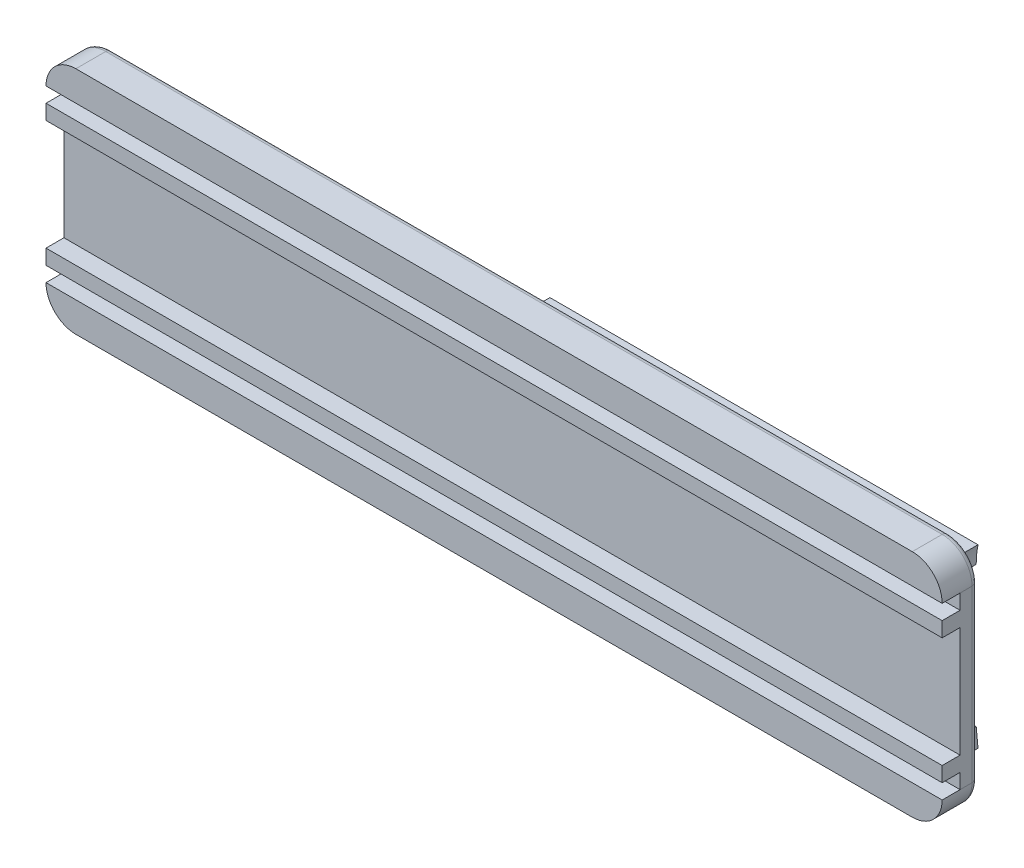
ISO-10303-21;
HEADER;
FILE_DESCRIPTION(('STEP AP214'),'2;1');
FILE_NAME('part.step','',(''),(''),'','','');
FILE_SCHEMA(('AUTOMOTIVE_DESIGN { 1 0 10303 214 1 1 1 1 }'));
ENDSEC;
DATA;
#1=APPLICATION_CONTEXT('core data for automotive mechanical design processes');
#2=APPLICATION_PROTOCOL_DEFINITION('international standard','automotive_design',2000,#1);
#3=PRODUCT_CONTEXT('',#1,'mechanical');
#4=PRODUCT('Part','Part','',(#3));
#5=PRODUCT_RELATED_PRODUCT_CATEGORY('part','',(#4));
#6=PRODUCT_DEFINITION_FORMATION('','',#4);
#7=PRODUCT_DEFINITION_CONTEXT('part definition',#1,'design');
#8=PRODUCT_DEFINITION('design','',#6,#7);
#9=PRODUCT_DEFINITION_SHAPE('','',#8);
#10=(LENGTH_UNIT() NAMED_UNIT(*) SI_UNIT(.MILLI.,.METRE.));
#11=(NAMED_UNIT(*) PLANE_ANGLE_UNIT() SI_UNIT($,.RADIAN.));
#12=(NAMED_UNIT(*) SI_UNIT($,.STERADIAN.) SOLID_ANGLE_UNIT());
#13=UNCERTAINTY_MEASURE_WITH_UNIT(LENGTH_MEASURE(1.E-05),#10,'distance_accuracy_value','');
#14=(GEOMETRIC_REPRESENTATION_CONTEXT(3) GLOBAL_UNCERTAINTY_ASSIGNED_CONTEXT((#13)) GLOBAL_UNIT_ASSIGNED_CONTEXT((#10,
#11,#12)) REPRESENTATION_CONTEXT('',''));
#15=CARTESIAN_POINT('',(0.,0.,0.));
#16=DIRECTION('',(0.,0.,1.));
#17=DIRECTION('',(1.,0.,0.));
#18=AXIS2_PLACEMENT_3D('',#15,#16,#17);
#19=CARTESIAN_POINT('',(56.,5.99999999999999,22.));
#20=DIRECTION('',(-1.,0.,0.));
#21=DIRECTION('',(0.,-1.,0.));
#22=AXIS2_PLACEMENT_3D('',#19,#20,#21);
#23=PLANE('',#22);
#24=DIRECTION('',(0.,0.,-1.));
#25=VECTOR('',#24,1.);
#26=CARTESIAN_POINT('',(56.,-61.,22.));
#27=LINE('',#26,#25);
#28=CARTESIAN_POINT('',(56.,-61.,16.));
#29=VERTEX_POINT('',#28);
#30=CARTESIAN_POINT('',(56.,-61.,12.));
#31=VERTEX_POINT('',#30);
#32=EDGE_CURVE('E403',#29,#31,#27,.T.);
#33=ORIENTED_EDGE('',*,*,#32,.T.);
#34=DIRECTION('',(0.,1.,0.));
#35=VECTOR('',#34,1.);
#36=CARTESIAN_POINT('',(56.,-4.00000000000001,12.));
#37=LINE('',#36,#35);
#38=CARTESIAN_POINT('',(56.,-4.00000000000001,12.));
#39=VERTEX_POINT('',#38);
#40=EDGE_CURVE('E458',#31,#39,#37,.T.);
#41=ORIENTED_EDGE('',*,*,#40,.T.);
#42=DIRECTION('',(0.,0.,-1.));
#43=VECTOR('',#42,1.);
#44=CARTESIAN_POINT('',(56.,-4.00000000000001,22.));
#45=LINE('',#44,#43);
#46=CARTESIAN_POINT('',(56.,-4.00000000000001,16.));
#47=VERTEX_POINT('',#46);
#48=EDGE_CURVE('E260',#39,#47,#45,.F.);
#49=ORIENTED_EDGE('',*,*,#48,.T.);
#50=DIRECTION('',(0.,1.,0.));
#51=VECTOR('',#50,1.);
#52=CARTESIAN_POINT('',(56.,0.,16.));
#53=LINE('',#52,#51);
#54=CARTESIAN_POINT('',(56.,-9.00000000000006,16.));
#55=VERTEX_POINT('',#54);
#56=EDGE_CURVE('E253',#55,#47,#53,.T.);
#57=ORIENTED_EDGE('',*,*,#56,.F.);
#58=DIRECTION('',(0.,0.,1.));
#59=VECTOR('',#58,1.);
#60=CARTESIAN_POINT('',(56.,-9.00000000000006,16.));
#61=LINE('',#60,#59);
#62=CARTESIAN_POINT('',(56.,-9.00000000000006,22.));
#63=VERTEX_POINT('',#62);
#64=EDGE_CURVE('E235',#55,#63,#61,.T.);
#65=ORIENTED_EDGE('',*,*,#64,.T.);
#66=DIRECTION('',(0.,1.,0.));
#67=VECTOR('',#66,1.);
#68=CARTESIAN_POINT('',(56.,5.99999999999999,22.));
#69=LINE('',#68,#67);
#70=CARTESIAN_POINT('',(56.,-14.,22.));
#71=VERTEX_POINT('',#70);
#72=EDGE_CURVE('E356',#71,#63,#69,.T.);
#73=ORIENTED_EDGE('',*,*,#72,.F.);
#74=DIRECTION('',(0.,0.,1.));
#75=VECTOR('',#74,1.);
#76=CARTESIAN_POINT('',(56.,-14.,16.));
#77=LINE('',#76,#75);
#78=CARTESIAN_POINT('',(56.,-14.,16.));
#79=VERTEX_POINT('',#78);
#80=EDGE_CURVE('E319',#79,#71,#77,.T.);
#81=ORIENTED_EDGE('',*,*,#80,.F.);
#82=DIRECTION('',(0.,1.,0.));
#83=VECTOR('',#82,1.);
#84=CARTESIAN_POINT('',(56.,0.,16.));
#85=LINE('',#84,#83);
#86=CARTESIAN_POINT('',(56.,-51.0000000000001,16.));
#87=VERTEX_POINT('',#86);
#88=EDGE_CURVE('E305',#87,#79,#85,.T.);
#89=ORIENTED_EDGE('',*,*,#88,.F.);
#90=DIRECTION('',(0.,0.,1.));
#91=VECTOR('',#90,1.);
#92=CARTESIAN_POINT('',(56.,-51.0000000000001,16.));
#93=LINE('',#92,#91);
#94=CARTESIAN_POINT('',(56.,-51.0000000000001,22.));
#95=VERTEX_POINT('',#94);
#96=EDGE_CURVE('E321',#87,#95,#93,.T.);
#97=ORIENTED_EDGE('',*,*,#96,.T.);
#98=CARTESIAN_POINT('',(56.,-56.0000000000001,22.));
#99=VERTEX_POINT('',#98);
#100=EDGE_CURVE('E357',#99,#95,#69,.T.);
#101=ORIENTED_EDGE('',*,*,#100,.F.);
#102=DIRECTION('',(0.,0.,1.));
#103=VECTOR('',#102,1.);
#104=CARTESIAN_POINT('',(56.,-56.0000000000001,16.));
#105=LINE('',#104,#103);
#106=CARTESIAN_POINT('',(56.,-56.0000000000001,16.));
#107=VERTEX_POINT('',#106);
#108=EDGE_CURVE('E268',#107,#99,#105,.T.);
#109=ORIENTED_EDGE('',*,*,#108,.F.);
#110=DIRECTION('',(0.,-1.,0.));
#111=VECTOR('',#110,1.);
#112=CARTESIAN_POINT('',(55.9999999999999,0.,16.));
#113=LINE('',#112,#111);
#114=EDGE_CURVE('E285',#107,#29,#113,.T.);
#115=ORIENTED_EDGE('',*,*,#114,.T.);
#116=EDGE_LOOP('',(#33,#41,#49,#57,#65,#73,#81,#89,#97,#101,#109,#115));
#117=FACE_BOUND('',#116,.T.);
#118=ADVANCED_FACE('F38',(#117),#23,.F.);
#119=CARTESIAN_POINT('',(-244.,5.99999999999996,22.));
#120=DIRECTION('',(1.,0.,0.));
#121=DIRECTION('',(0.,0.,-1.));
#122=AXIS2_PLACEMENT_3D('',#119,#120,#121);
#123=PLANE('',#122);
#124=DIRECTION('',(0.,0.,-1.));
#125=VECTOR('',#124,1.);
#126=CARTESIAN_POINT('',(-244.,-4.00000000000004,22.));
#127=LINE('',#126,#125);
#128=CARTESIAN_POINT('',(-244.,-4.00000000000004,16.));
#129=VERTEX_POINT('',#128);
#130=CARTESIAN_POINT('',(-244.,-4.00000000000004,12.));
#131=VERTEX_POINT('',#130);
#132=EDGE_CURVE('E427',#129,#131,#127,.T.);
#133=ORIENTED_EDGE('',*,*,#132,.T.);
#134=DIRECTION('',(0.,-1.,0.));
#135=VECTOR('',#134,1.);
#136=CARTESIAN_POINT('',(-244.,-61.0000000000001,12.));
#137=LINE('',#136,#135);
#138=CARTESIAN_POINT('',(-244.,-61.0000000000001,12.));
#139=VERTEX_POINT('',#138);
#140=EDGE_CURVE('E450',#131,#139,#137,.T.);
#141=ORIENTED_EDGE('',*,*,#140,.T.);
#142=DIRECTION('',(0.,0.,-1.));
#143=VECTOR('',#142,1.);
#144=CARTESIAN_POINT('',(-244.,-61.0000000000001,22.));
#145=LINE('',#144,#143);
#146=CARTESIAN_POINT('',(-244.,-61.0000000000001,16.));
#147=VERTEX_POINT('',#146);
#148=EDGE_CURVE('E425',#139,#147,#145,.F.);
#149=ORIENTED_EDGE('',*,*,#148,.T.);
#150=DIRECTION('',(0.,-1.,0.));
#151=VECTOR('',#150,1.);
#152=CARTESIAN_POINT('',(-244.,0.,16.));
#153=LINE('',#152,#151);
#154=CARTESIAN_POINT('',(-244.,-56.0000000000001,16.));
#155=VERTEX_POINT('',#154);
#156=EDGE_CURVE('E278',#155,#147,#153,.T.);
#157=ORIENTED_EDGE('',*,*,#156,.F.);
#158=DIRECTION('',(0.,0.,1.));
#159=VECTOR('',#158,1.);
#160=CARTESIAN_POINT('',(-244.,-56.0000000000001,16.));
#161=LINE('',#160,#159);
#162=CARTESIAN_POINT('',(-244.,-56.0000000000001,22.));
#163=VERTEX_POINT('',#162);
#164=EDGE_CURVE('E288',#155,#163,#161,.T.);
#165=ORIENTED_EDGE('',*,*,#164,.T.);
#166=DIRECTION('',(0.,-1.,0.));
#167=VECTOR('',#166,1.);
#168=CARTESIAN_POINT('',(-244.,5.99999999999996,22.));
#169=LINE('',#168,#167);
#170=CARTESIAN_POINT('',(-244.,-51.0000000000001,22.));
#171=VERTEX_POINT('',#170);
#172=EDGE_CURVE('E362',#171,#163,#169,.T.);
#173=ORIENTED_EDGE('',*,*,#172,.F.);
#174=DIRECTION('',(0.,0.,1.));
#175=VECTOR('',#174,1.);
#176=CARTESIAN_POINT('',(-244.,-51.0000000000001,16.));
#177=LINE('',#176,#175);
#178=CARTESIAN_POINT('',(-244.,-51.0000000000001,16.));
#179=VERTEX_POINT('',#178);
#180=EDGE_CURVE('E310',#179,#171,#177,.T.);
#181=ORIENTED_EDGE('',*,*,#180,.F.);
#182=DIRECTION('',(0.,-1.,0.));
#183=VECTOR('',#182,1.);
#184=CARTESIAN_POINT('',(-244.,0.,16.));
#185=LINE('',#184,#183);
#186=CARTESIAN_POINT('',(-244.,-14.,16.));
#187=VERTEX_POINT('',#186);
#188=EDGE_CURVE('E298',#187,#179,#185,.T.);
#189=ORIENTED_EDGE('',*,*,#188,.F.);
#190=DIRECTION('',(0.,0.,1.));
#191=VECTOR('',#190,1.);
#192=CARTESIAN_POINT('',(-244.,-14.,16.));
#193=LINE('',#192,#191);
#194=CARTESIAN_POINT('',(-244.,-14.,22.));
#195=VERTEX_POINT('',#194);
#196=EDGE_CURVE('E315',#187,#195,#193,.T.);
#197=ORIENTED_EDGE('',*,*,#196,.T.);
#198=CARTESIAN_POINT('',(-244.,-9.00000000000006,22.));
#199=VERTEX_POINT('',#198);
#200=EDGE_CURVE('E363',#199,#195,#169,.T.);
#201=ORIENTED_EDGE('',*,*,#200,.F.);
#202=DIRECTION('',(0.,0.,1.));
#203=VECTOR('',#202,1.);
#204=CARTESIAN_POINT('',(-244.,-9.00000000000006,16.));
#205=LINE('',#204,#203);
#206=CARTESIAN_POINT('',(-244.,-9.00000000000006,16.));
#207=VERTEX_POINT('',#206);
#208=EDGE_CURVE('E271',#207,#199,#205,.T.);
#209=ORIENTED_EDGE('',*,*,#208,.F.);
#210=DIRECTION('',(0.,-1.,0.));
#211=VECTOR('',#210,1.);
#212=CARTESIAN_POINT('',(-244.,0.,16.));
#213=LINE('',#212,#211);
#214=EDGE_CURVE('E247',#129,#207,#213,.T.);
#215=ORIENTED_EDGE('',*,*,#214,.F.);
#216=EDGE_LOOP('',(#133,#141,#149,#157,#165,#173,#181,#189,#197,#201,#209,#215));
#217=FACE_BOUND('',#216,.T.);
#218=ADVANCED_FACE('F512',(#217),#123,.F.);
#219=CARTESIAN_POINT('',(0.,0.,22.));
#220=DIRECTION('',(0.,0.,-1.));
#221=DIRECTION('',(-1.,0.,0.));
#222=AXIS2_PLACEMENT_3D('',#219,#220,#221);
#223=PLANE('',#222);
#224=DIRECTION('',(-1.,0.,0.));
#225=VECTOR('',#224,1.);
#226=CARTESIAN_POINT('',(0.,-9.00000000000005,22.));
#227=LINE('',#226,#225);
#228=EDGE_CURVE('E241',#63,#199,#227,.T.);
#229=ORIENTED_EDGE('',*,*,#228,.T.);
#230=ORIENTED_EDGE('',*,*,#200,.T.);
#231=DIRECTION('',(1.,0.,0.));
#232=VECTOR('',#231,1.);
#233=CARTESIAN_POINT('',(0.,-14.,22.));
#234=LINE('',#233,#232);
#235=EDGE_CURVE('E302',#195,#71,#234,.T.);
#236=ORIENTED_EDGE('',*,*,#235,.T.);
#237=ORIENTED_EDGE('',*,*,#72,.T.);
#238=EDGE_LOOP('',(#229,#230,#236,#237));
#239=FACE_BOUND('',#238,.T.);
#240=ADVANCED_FACE('F516',(#239),#223,.F.);
#241=DIRECTION('',(1.,0.,0.));
#242=VECTOR('',#241,1.);
#243=CARTESIAN_POINT('',(0.,-4.00000000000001,22.));
#244=LINE('',#243,#242);
#245=CARTESIAN_POINT('',(-244.,-4.00000000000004,22.));
#246=VERTEX_POINT('',#245);
#247=CARTESIAN_POINT('',(56.,-4.00000000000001,22.));
#248=VERTEX_POINT('',#247);
#249=EDGE_CURVE('E257',#246,#248,#244,.T.);
#250=ORIENTED_EDGE('',*,*,#249,.T.);
#251=CARTESIAN_POINT('',(46.,-4.00000000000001,22.));
#252=DIRECTION('',(0.,0.,-1.));
#253=DIRECTION('',(-1.,0.,0.));
#254=AXIS2_PLACEMENT_3D('',#251,#252,#253);
#255=CIRCLE('',#254,10.);
#256=CARTESIAN_POINT('',(46.,5.99999999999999,22.));
#257=VERTEX_POINT('',#256);
#258=EDGE_CURVE('E415',#248,#257,#255,.F.);
#259=ORIENTED_EDGE('',*,*,#258,.T.);
#260=DIRECTION('',(-1.,0.,0.));
#261=VECTOR('',#260,1.);
#262=CARTESIAN_POINT('',(56.,5.99999999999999,22.));
#263=LINE('',#262,#261);
#264=CARTESIAN_POINT('',(-234.,5.99999999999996,22.));
#265=VERTEX_POINT('',#264);
#266=EDGE_CURVE('E359',#257,#265,#263,.T.);
#267=ORIENTED_EDGE('',*,*,#266,.T.);
#268=CARTESIAN_POINT('',(-234.,-4.00000000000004,22.));
#269=DIRECTION('',(0.,0.,-1.));
#270=DIRECTION('',(-1.,0.,0.));
#271=AXIS2_PLACEMENT_3D('',#268,#269,#270);
#272=CIRCLE('',#271,10.);
#273=EDGE_CURVE('E412',#265,#246,#272,.F.);
#274=ORIENTED_EDGE('',*,*,#273,.T.);
#275=EDGE_LOOP('',(#250,#259,#267,#274));
#276=FACE_BOUND('',#275,.T.);
#277=ADVANCED_FACE('F502',(#276),#223,.F.);
#278=DIRECTION('',(1.,0.,0.));
#279=VECTOR('',#278,1.);
#280=CARTESIAN_POINT('',(0.,-56.0000000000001,22.));
#281=LINE('',#280,#279);
#282=EDGE_CURVE('E289',#163,#99,#281,.T.);
#283=ORIENTED_EDGE('',*,*,#282,.T.);
#284=ORIENTED_EDGE('',*,*,#100,.T.);
#285=DIRECTION('',(1.,0.,0.));
#286=VECTOR('',#285,1.);
#287=CARTESIAN_POINT('',(0.,-51.0000000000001,22.));
#288=LINE('',#287,#286);
#289=EDGE_CURVE('E273',#171,#95,#288,.T.);
#290=ORIENTED_EDGE('',*,*,#289,.F.);
#291=ORIENTED_EDGE('',*,*,#172,.T.);
#292=EDGE_LOOP('',(#283,#284,#290,#291));
#293=FACE_BOUND('',#292,.T.);
#294=ADVANCED_FACE('F533',(#293),#223,.F.);
#295=CARTESIAN_POINT('',(0.,0.,10.));
#296=DIRECTION('',(0.,0.,-1.));
#297=DIRECTION('',(-1.,0.,0.));
#298=AXIS2_PLACEMENT_3D('',#295,#296,#297);
#299=PLANE('',#298);
#300=DIRECTION('',(1.,0.,0.));
#301=VECTOR('',#300,1.);
#302=CARTESIAN_POINT('',(-234.,-69.0000000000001,10.));
#303=LINE('',#302,#301);
#304=CARTESIAN_POINT('',(46.,-69.,10.));
#305=VERTEX_POINT('',#304);
#306=CARTESIAN_POINT('',(-234.,-69.0000000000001,10.));
#307=VERTEX_POINT('',#306);
#308=EDGE_CURVE('E430',#305,#307,#303,.F.);
#309=ORIENTED_EDGE('',*,*,#308,.T.);
#310=CARTESIAN_POINT('',(-234.,-61.0000000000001,10.));
#311=DIRECTION('',(0.,0.,-1.));
#312=DIRECTION('',(-1.,0.,0.));
#313=AXIS2_PLACEMENT_3D('',#310,#311,#312);
#314=CIRCLE('',#313,8.);
#315=CARTESIAN_POINT('',(-242.,-61.0000000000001,10.));
#316=VERTEX_POINT('',#315);
#317=EDGE_CURVE('E444',#307,#316,#314,.T.);
#318=ORIENTED_EDGE('',*,*,#317,.T.);
#319=DIRECTION('',(0.,-1.,0.));
#320=VECTOR('',#319,1.);
#321=CARTESIAN_POINT('',(-242.,-4.00000000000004,10.));
#322=LINE('',#321,#320);
#323=CARTESIAN_POINT('',(-242.,-4.00000000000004,10.));
#324=VERTEX_POINT('',#323);
#325=EDGE_CURVE('E442',#316,#324,#322,.F.);
#326=ORIENTED_EDGE('',*,*,#325,.T.);
#327=CARTESIAN_POINT('',(-234.,-4.00000000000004,10.));
#328=DIRECTION('',(0.,0.,-1.));
#329=DIRECTION('',(-1.,0.,0.));
#330=AXIS2_PLACEMENT_3D('',#327,#328,#329);
#331=CIRCLE('',#330,8.);
#332=CARTESIAN_POINT('',(-234.,3.99999999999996,10.));
#333=VERTEX_POINT('',#332);
#334=EDGE_CURVE('E440',#324,#333,#331,.T.);
#335=ORIENTED_EDGE('',*,*,#334,.T.);
#336=DIRECTION('',(-1.,0.,0.));
#337=VECTOR('',#336,1.);
#338=CARTESIAN_POINT('',(46.,3.99999999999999,10.));
#339=LINE('',#338,#337);
#340=CARTESIAN_POINT('',(46.,3.99999999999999,10.));
#341=VERTEX_POINT('',#340);
#342=EDGE_CURVE('E438',#333,#341,#339,.F.);
#343=ORIENTED_EDGE('',*,*,#342,.T.);
#344=CARTESIAN_POINT('',(46.,-4.00000000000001,10.));
#345=DIRECTION('',(0.,0.,-1.));
#346=DIRECTION('',(-1.,0.,0.));
#347=AXIS2_PLACEMENT_3D('',#344,#345,#346);
#348=CIRCLE('',#347,8.);
#349=CARTESIAN_POINT('',(54.,-4.00000000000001,10.));
#350=VERTEX_POINT('',#349);
#351=EDGE_CURVE('E436',#341,#350,#348,.T.);
#352=ORIENTED_EDGE('',*,*,#351,.T.);
#353=DIRECTION('',(0.,1.,0.));
#354=VECTOR('',#353,1.);
#355=CARTESIAN_POINT('',(54.,-61.,10.));
#356=LINE('',#355,#354);
#357=CARTESIAN_POINT('',(54.,-61.,10.));
#358=VERTEX_POINT('',#357);
#359=EDGE_CURVE('E434',#350,#358,#356,.F.);
#360=ORIENTED_EDGE('',*,*,#359,.T.);
#361=CARTESIAN_POINT('',(46.,-61.,10.));
#362=DIRECTION('',(0.,0.,-1.));
#363=DIRECTION('',(-1.,0.,0.));
#364=AXIS2_PLACEMENT_3D('',#361,#362,#363);
#365=CIRCLE('',#364,8.);
#366=EDGE_CURVE('E432',#358,#305,#365,.T.);
#367=ORIENTED_EDGE('',*,*,#366,.T.);
#368=EDGE_LOOP('',(#309,#318,#326,#335,#343,#352,#360,#367));
#369=FACE_BOUND('',#368,.T.);
#370=CARTESIAN_POINT('',(75.5265948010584,-9.00000000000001,10.));
#371=DIRECTION('',(0.,0.,-1.));
#372=DIRECTION('',(-1.,0.,0.));
#373=AXIS2_PLACEMENT_3D('',#370,#371,#372);
#374=CIRCLE('',#373,30.1300481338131);
#375=CARTESIAN_POINT('',(45.3965466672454,-9.00000000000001,10.));
#376=VERTEX_POINT('',#375);
#377=CARTESIAN_POINT('',(46.,-3.,10.));
#378=VERTEX_POINT('',#377);
#379=EDGE_CURVE('E379',#376,#378,#374,.T.);
#380=ORIENTED_EDGE('',*,*,#379,.T.);
#381=DIRECTION('',(-1.,0.,0.));
#382=VECTOR('',#381,1.);
#383=CARTESIAN_POINT('',(46.,-3.,10.));
#384=LINE('',#383,#382);
#385=CARTESIAN_POINT('',(-97.3056630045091,-3.,10.));
#386=VERTEX_POINT('',#385);
#387=EDGE_CURVE('E369',#378,#386,#384,.T.);
#388=ORIENTED_EDGE('',*,*,#387,.T.);
#389=DIRECTION('',(0.,-1.,0.));
#390=VECTOR('',#389,1.);
#391=CARTESIAN_POINT('',(-97.3056630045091,-9.00000000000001,10.));
#392=LINE('',#391,#390);
#393=CARTESIAN_POINT('',(-97.3056630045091,-9.00000000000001,10.));
#394=VERTEX_POINT('',#393);
#395=EDGE_CURVE('E372',#386,#394,#392,.T.);
#396=ORIENTED_EDGE('',*,*,#395,.T.);
#397=DIRECTION('',(1.,0.,0.));
#398=VECTOR('',#397,1.);
#399=CARTESIAN_POINT('',(-92.7944290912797,-9.00000000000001,10.));
#400=LINE('',#399,#398);
#401=EDGE_CURVE('E376',#394,#376,#400,.T.);
#402=ORIENTED_EDGE('',*,*,#401,.T.);
#403=EDGE_LOOP('',(#380,#388,#396,#402));
#404=FACE_BOUND('',#403,.T.);
#405=DIRECTION('',(-1.,0.,0.));
#406=VECTOR('',#405,1.);
#407=CARTESIAN_POINT('',(-92.7944290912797,-56.,10.));
#408=LINE('',#407,#406);
#409=CARTESIAN_POINT('',(45.3965466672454,-56.,10.));
#410=VERTEX_POINT('',#409);
#411=CARTESIAN_POINT('',(-97.305663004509,-56.,10.));
#412=VERTEX_POINT('',#411);
#413=EDGE_CURVE('E325',#410,#412,#408,.T.);
#414=ORIENTED_EDGE('',*,*,#413,.T.);
#415=DIRECTION('',(0.,-1.,0.));
#416=VECTOR('',#415,1.);
#417=CARTESIAN_POINT('',(-97.305663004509,-56.,10.));
#418=LINE('',#417,#416);
#419=CARTESIAN_POINT('',(-97.305663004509,-62.,10.));
#420=VERTEX_POINT('',#419);
#421=EDGE_CURVE('E328',#412,#420,#418,.T.);
#422=ORIENTED_EDGE('',*,*,#421,.T.);
#423=DIRECTION('',(1.,0.,0.));
#424=VECTOR('',#423,1.);
#425=CARTESIAN_POINT('',(-97.305663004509,-62.,10.));
#426=LINE('',#425,#424);
#427=CARTESIAN_POINT('',(46.,-62.,10.));
#428=VERTEX_POINT('',#427);
#429=EDGE_CURVE('E332',#420,#428,#426,.T.);
#430=ORIENTED_EDGE('',*,*,#429,.T.);
#431=DIRECTION('',(-0.100070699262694,0.994980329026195,0.));
#432=VECTOR('',#431,1.);
#433=CARTESIAN_POINT('',(45.3965466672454,-56.,10.));
#434=LINE('',#433,#432);
#435=EDGE_CURVE('E335',#428,#410,#434,.T.);
#436=ORIENTED_EDGE('',*,*,#435,.T.);
#437=EDGE_LOOP('',(#414,#422,#430,#436));
#438=FACE_BOUND('',#437,.T.);
#439=ADVANCED_FACE('F570',(#369,#404,#438),#299,.T.);
#440=CARTESIAN_POINT('',(46.,-3.,10.));
#441=DIRECTION('',(0.,-1.,0.));
#442=DIRECTION('',(0.,0.,-1.));
#443=AXIS2_PLACEMENT_3D('',#440,#441,#442);
#444=PLANE('',#443);
#445=DIRECTION('',(-1.,0.,0.));
#446=VECTOR('',#445,1.);
#447=CARTESIAN_POINT('',(46.,-3.,0.));
#448=LINE('',#447,#446);
#449=CARTESIAN_POINT('',(46.,-3.,0.));
#450=VERTEX_POINT('',#449);
#451=CARTESIAN_POINT('',(-97.3056630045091,-3.,0.));
#452=VERTEX_POINT('',#451);
#453=EDGE_CURVE('E368',#450,#452,#448,.T.);
#454=ORIENTED_EDGE('',*,*,#453,.T.);
#455=DIRECTION('',(0.,0.,-1.));
#456=VECTOR('',#455,1.);
#457=CARTESIAN_POINT('',(-97.3056630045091,-3.,10.));
#458=LINE('',#457,#456);
#459=EDGE_CURVE('E399',#386,#452,#458,.T.);
#460=ORIENTED_EDGE('',*,*,#459,.F.);
#461=ORIENTED_EDGE('',*,*,#387,.F.);
#462=DIRECTION('',(0.,0.,-1.));
#463=VECTOR('',#462,1.);
#464=CARTESIAN_POINT('',(46.,-3.,10.));
#465=LINE('',#464,#463);
#466=EDGE_CURVE('E382',#378,#450,#465,.T.);
#467=ORIENTED_EDGE('',*,*,#466,.T.);
#468=EDGE_LOOP('',(#454,#460,#461,#467));
#469=FACE_BOUND('',#468,.T.);
#470=ADVANCED_FACE('F614',(#469),#444,.F.);
#471=CARTESIAN_POINT('',(-97.3056630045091,-9.00000000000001,10.));
#472=DIRECTION('',(1.,0.,0.));
#473=DIRECTION('',(0.,0.,-1.));
#474=AXIS2_PLACEMENT_3D('',#471,#472,#473);
#475=PLANE('',#474);
#476=DIRECTION('',(0.,-1.,0.));
#477=VECTOR('',#476,1.);
#478=CARTESIAN_POINT('',(-97.3056630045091,-9.00000000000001,0.));
#479=LINE('',#478,#477);
#480=CARTESIAN_POINT('',(-97.3056630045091,-9.00000000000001,0.));
#481=VERTEX_POINT('',#480);
#482=EDGE_CURVE('E385',#452,#481,#479,.T.);
#483=ORIENTED_EDGE('',*,*,#482,.T.);
#484=DIRECTION('',(0.,0.,-1.));
#485=VECTOR('',#484,1.);
#486=CARTESIAN_POINT('',(-97.3056630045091,-9.00000000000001,10.));
#487=LINE('',#486,#485);
#488=EDGE_CURVE('E396',#394,#481,#487,.T.);
#489=ORIENTED_EDGE('',*,*,#488,.F.);
#490=ORIENTED_EDGE('',*,*,#395,.F.);
#491=ORIENTED_EDGE('',*,*,#459,.T.);
#492=EDGE_LOOP('',(#483,#489,#490,#491));
#493=FACE_BOUND('',#492,.T.);
#494=ADVANCED_FACE('F610',(#493),#475,.F.);
#495=CARTESIAN_POINT('',(-92.7944290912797,-9.00000000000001,10.));
#496=DIRECTION('',(0.,1.,0.));
#497=DIRECTION('',(0.,0.,1.));
#498=AXIS2_PLACEMENT_3D('',#495,#496,#497);
#499=PLANE('',#498);
#500=DIRECTION('',(1.,0.,0.));
#501=VECTOR('',#500,1.);
#502=CARTESIAN_POINT('',(-92.7944290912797,-9.00000000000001,0.));
#503=LINE('',#502,#501);
#504=CARTESIAN_POINT('',(45.3965466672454,-9.00000000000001,0.));
#505=VERTEX_POINT('',#504);
#506=EDGE_CURVE('E388',#481,#505,#503,.T.);
#507=ORIENTED_EDGE('',*,*,#506,.T.);
#508=DIRECTION('',(0.,0.,-1.));
#509=VECTOR('',#508,1.);
#510=CARTESIAN_POINT('',(45.3965466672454,-9.00000000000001,10.));
#511=LINE('',#510,#509);
#512=EDGE_CURVE('E393',#376,#505,#511,.T.);
#513=ORIENTED_EDGE('',*,*,#512,.F.);
#514=ORIENTED_EDGE('',*,*,#401,.F.);
#515=ORIENTED_EDGE('',*,*,#488,.T.);
#516=EDGE_LOOP('',(#507,#513,#514,#515));
#517=FACE_BOUND('',#516,.T.);
#518=ADVANCED_FACE('F606',(#517),#499,.F.);
#519=CARTESIAN_POINT('',(75.5265948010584,-9.00000000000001,10.));
#520=DIRECTION('',(0.,0.,-1.));
#521=DIRECTION('',(-1.,0.,0.));
#522=AXIS2_PLACEMENT_3D('',#519,#520,#521);
#523=CYLINDRICAL_SURFACE('',#522,30.1300481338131);
#524=CARTESIAN_POINT('',(75.5265948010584,-9.00000000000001,0.));
#525=DIRECTION('',(0.,0.,-1.));
#526=DIRECTION('',(-1.,0.,0.));
#527=AXIS2_PLACEMENT_3D('',#524,#525,#526);
#528=CIRCLE('',#527,30.1300481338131);
#529=EDGE_CURVE('E373',#505,#450,#528,.T.);
#530=ORIENTED_EDGE('',*,*,#529,.T.);
#531=ORIENTED_EDGE('',*,*,#466,.F.);
#532=ORIENTED_EDGE('',*,*,#379,.F.);
#533=ORIENTED_EDGE('',*,*,#512,.T.);
#534=EDGE_LOOP('',(#530,#531,#532,#533));
#535=FACE_BOUND('',#534,.T.);
#536=ADVANCED_FACE('F602',(#535),#523,.F.);
#537=CARTESIAN_POINT('',(75.5265948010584,-9.00000000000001,0.));
#538=DIRECTION('',(0.,0.,-1.));
#539=DIRECTION('',(-1.,0.,0.));
#540=AXIS2_PLACEMENT_3D('',#537,#538,#539);
#541=PLANE('',#540);
#542=ORIENTED_EDGE('',*,*,#453,.F.);
#543=ORIENTED_EDGE('',*,*,#529,.F.);
#544=ORIENTED_EDGE('',*,*,#506,.F.);
#545=ORIENTED_EDGE('',*,*,#482,.F.);
#546=EDGE_LOOP('',(#542,#543,#544,#545));
#547=FACE_BOUND('',#546,.T.);
#548=ADVANCED_FACE('F599',(#547),#541,.T.);
#549=CARTESIAN_POINT('',(56.,5.99999999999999,22.));
#550=DIRECTION('',(0.,-1.,0.));
#551=DIRECTION('',(1.,0.,0.));
#552=AXIS2_PLACEMENT_3D('',#549,#550,#551);
#553=PLANE('',#552);
#554=DIRECTION('',(0.,0.,-1.));
#555=VECTOR('',#554,1.);
#556=CARTESIAN_POINT('',(46.,5.99999999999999,22.));
#557=LINE('',#556,#555);
#558=CARTESIAN_POINT('',(46.,5.99999999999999,12.));
#559=VERTEX_POINT('',#558);
#560=EDGE_CURVE('E422',#257,#559,#557,.T.);
#561=ORIENTED_EDGE('',*,*,#560,.T.);
#562=DIRECTION('',(-1.,0.,0.));
#563=VECTOR('',#562,1.);
#564=CARTESIAN_POINT('',(-234.,5.99999999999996,12.));
#565=LINE('',#564,#563);
#566=CARTESIAN_POINT('',(-234.,5.99999999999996,12.));
#567=VERTEX_POINT('',#566);
#568=EDGE_CURVE('E454',#559,#567,#565,.T.);
#569=ORIENTED_EDGE('',*,*,#568,.T.);
#570=DIRECTION('',(0.,0.,-1.));
#571=VECTOR('',#570,1.);
#572=CARTESIAN_POINT('',(-234.,5.99999999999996,22.));
#573=LINE('',#572,#571);
#574=EDGE_CURVE('E420',#567,#265,#573,.F.);
#575=ORIENTED_EDGE('',*,*,#574,.T.);
#576=ORIENTED_EDGE('',*,*,#266,.F.);
#577=EDGE_LOOP('',(#561,#569,#575,#576));
#578=FACE_BOUND('',#577,.T.);
#579=ADVANCED_FACE('F498',(#578),#553,.F.);
#580=CARTESIAN_POINT('',(56.,-71.,22.));
#581=DIRECTION('',(0.,1.,0.));
#582=DIRECTION('',(-1.,0.,0.));
#583=AXIS2_PLACEMENT_3D('',#580,#581,#582);
#584=PLANE('',#583);
#585=DIRECTION('',(0.,0.,-1.));
#586=VECTOR('',#585,1.);
#587=CARTESIAN_POINT('',(-234.,-71.0000000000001,22.));
#588=LINE('',#587,#586);
#589=CARTESIAN_POINT('',(-234.,-71.0000000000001,22.));
#590=VERTEX_POINT('',#589);
#591=CARTESIAN_POINT('',(-234.,-71.0000000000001,12.));
#592=VERTEX_POINT('',#591);
#593=EDGE_CURVE('E406',#590,#592,#588,.T.);
#594=ORIENTED_EDGE('',*,*,#593,.T.);
#595=DIRECTION('',(1.,0.,0.));
#596=VECTOR('',#595,1.);
#597=CARTESIAN_POINT('',(46.,-71.,12.));
#598=LINE('',#597,#596);
#599=CARTESIAN_POINT('',(46.,-71.,12.));
#600=VERTEX_POINT('',#599);
#601=EDGE_CURVE('E11',#592,#600,#598,.T.);
#602=ORIENTED_EDGE('',*,*,#601,.T.);
#603=DIRECTION('',(0.,0.,-1.));
#604=VECTOR('',#603,1.);
#605=CARTESIAN_POINT('',(46.,-71.,22.));
#606=LINE('',#605,#604);
#607=CARTESIAN_POINT('',(46.,-71.,22.));
#608=VERTEX_POINT('',#607);
#609=EDGE_CURVE('E408',#600,#608,#606,.F.);
#610=ORIENTED_EDGE('',*,*,#609,.T.);
#611=DIRECTION('',(1.,0.,0.));
#612=VECTOR('',#611,1.);
#613=CARTESIAN_POINT('',(56.,-71.,22.));
#614=LINE('',#613,#612);
#615=EDGE_CURVE('E365',#590,#608,#614,.T.);
#616=ORIENTED_EDGE('',*,*,#615,.F.);
#617=EDGE_LOOP('',(#594,#602,#610,#616));
#618=FACE_BOUND('',#617,.T.);
#619=ADVANCED_FACE('F558',(#618),#584,.F.);
#620=CARTESIAN_POINT('',(46.,-61.,22.));
#621=DIRECTION('',(0.,0.,-1.));
#622=DIRECTION('',(-1.,0.,0.));
#623=AXIS2_PLACEMENT_3D('',#620,#621,#622);
#624=CIRCLE('',#623,10.);
#625=CARTESIAN_POINT('',(56.,-61.,22.));
#626=VERTEX_POINT('',#625);
#627=EDGE_CURVE('E417',#608,#626,#624,.F.);
#628=ORIENTED_EDGE('',*,*,#627,.T.);
#629=DIRECTION('',(1.,0.,0.));
#630=VECTOR('',#629,1.);
#631=CARTESIAN_POINT('',(0.,-61.,22.));
#632=LINE('',#631,#630);
#633=CARTESIAN_POINT('',(-244.,-61.0000000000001,22.));
#634=VERTEX_POINT('',#633);
#635=EDGE_CURVE('E279',#634,#626,#632,.T.);
#636=ORIENTED_EDGE('',*,*,#635,.F.);
#637=CARTESIAN_POINT('',(-234.,-61.0000000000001,22.));
#638=DIRECTION('',(0.,0.,-1.));
#639=DIRECTION('',(-1.,0.,0.));
#640=AXIS2_PLACEMENT_3D('',#637,#638,#639);
#641=CIRCLE('',#640,10.);
#642=EDGE_CURVE('E410',#634,#590,#641,.F.);
#643=ORIENTED_EDGE('',*,*,#642,.T.);
#644=ORIENTED_EDGE('',*,*,#615,.T.);
#645=EDGE_LOOP('',(#628,#636,#643,#644));
#646=FACE_BOUND('',#645,.T.);
#647=ADVANCED_FACE('F556',(#646),#223,.F.);
#648=CARTESIAN_POINT('',(-97.305663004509,-56.,10.));
#649=DIRECTION('',(1.,0.,0.));
#650=DIRECTION('',(0.,0.,-1.));
#651=AXIS2_PLACEMENT_3D('',#648,#649,#650);
#652=PLANE('',#651);
#653=DIRECTION('',(0.,-1.,0.));
#654=VECTOR('',#653,1.);
#655=CARTESIAN_POINT('',(-97.305663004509,-56.,0.));
#656=LINE('',#655,#654);
#657=CARTESIAN_POINT('',(-97.305663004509,-56.,0.));
#658=VERTEX_POINT('',#657);
#659=CARTESIAN_POINT('',(-97.305663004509,-62.,0.));
#660=VERTEX_POINT('',#659);
#661=EDGE_CURVE('E318',#658,#660,#656,.T.);
#662=ORIENTED_EDGE('',*,*,#661,.T.);
#663=DIRECTION('',(0.,0.,-1.));
#664=VECTOR('',#663,1.);
#665=CARTESIAN_POINT('',(-97.305663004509,-62.,10.));
#666=LINE('',#665,#664);
#667=EDGE_CURVE('E350',#420,#660,#666,.T.);
#668=ORIENTED_EDGE('',*,*,#667,.F.);
#669=ORIENTED_EDGE('',*,*,#421,.F.);
#670=DIRECTION('',(0.,0.,-1.));
#671=VECTOR('',#670,1.);
#672=CARTESIAN_POINT('',(-97.305663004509,-56.,10.));
#673=LINE('',#672,#671);
#674=EDGE_CURVE('E353',#412,#658,#673,.T.);
#675=ORIENTED_EDGE('',*,*,#674,.T.);
#676=EDGE_LOOP('',(#662,#668,#669,#675));
#677=FACE_BOUND('',#676,.T.);
#678=ADVANCED_FACE('F651',(#677),#652,.F.);
#679=CARTESIAN_POINT('',(-97.305663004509,-62.,10.));
#680=DIRECTION('',(0.,1.,0.));
#681=DIRECTION('',(-1.,0.,0.));
#682=AXIS2_PLACEMENT_3D('',#679,#680,#681);
#683=PLANE('',#682);
#684=DIRECTION('',(1.,0.,0.));
#685=VECTOR('',#684,1.);
#686=CARTESIAN_POINT('',(-97.305663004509,-62.,0.));
#687=LINE('',#686,#685);
#688=CARTESIAN_POINT('',(46.,-62.,0.));
#689=VERTEX_POINT('',#688);
#690=EDGE_CURVE('E340',#660,#689,#687,.T.);
#691=ORIENTED_EDGE('',*,*,#690,.T.);
#692=DIRECTION('',(0.,0.,-1.));
#693=VECTOR('',#692,1.);
#694=CARTESIAN_POINT('',(46.,-62.,10.));
#695=LINE('',#694,#693);
#696=EDGE_CURVE('E347',#428,#689,#695,.T.);
#697=ORIENTED_EDGE('',*,*,#696,.F.);
#698=ORIENTED_EDGE('',*,*,#429,.F.);
#699=ORIENTED_EDGE('',*,*,#667,.T.);
#700=EDGE_LOOP('',(#691,#697,#698,#699));
#701=FACE_BOUND('',#700,.T.);
#702=ADVANCED_FACE('F647',(#701),#683,.F.);
#703=CARTESIAN_POINT('',(45.3965466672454,-56.,10.));
#704=DIRECTION('',(-0.994980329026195,-0.100070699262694,0.));
#705=DIRECTION('',(0.100070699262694,-0.994980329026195,0.));
#706=AXIS2_PLACEMENT_3D('',#703,#704,#705);
#707=PLANE('',#706);
#708=DIRECTION('',(-0.100070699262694,0.994980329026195,0.));
#709=VECTOR('',#708,1.);
#710=CARTESIAN_POINT('',(45.3965466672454,-56.,0.));
#711=LINE('',#710,#709);
#712=CARTESIAN_POINT('',(45.3965466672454,-56.,0.));
#713=VERTEX_POINT('',#712);
#714=EDGE_CURVE('E342',#689,#713,#711,.T.);
#715=ORIENTED_EDGE('',*,*,#714,.T.);
#716=DIRECTION('',(0.,0.,-1.));
#717=VECTOR('',#716,1.);
#718=CARTESIAN_POINT('',(45.3965466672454,-56.,10.));
#719=LINE('',#718,#717);
#720=EDGE_CURVE('E338',#410,#713,#719,.T.);
#721=ORIENTED_EDGE('',*,*,#720,.F.);
#722=ORIENTED_EDGE('',*,*,#435,.F.);
#723=ORIENTED_EDGE('',*,*,#696,.T.);
#724=EDGE_LOOP('',(#715,#721,#722,#723));
#725=FACE_BOUND('',#724,.T.);
#726=ADVANCED_FACE('F643',(#725),#707,.F.);
#727=CARTESIAN_POINT('',(-92.7944290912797,-56.,10.));
#728=DIRECTION('',(0.,-1.,0.));
#729=DIRECTION('',(0.,0.,-1.));
#730=AXIS2_PLACEMENT_3D('',#727,#728,#729);
#731=PLANE('',#730);
#732=DIRECTION('',(-1.,0.,0.));
#733=VECTOR('',#732,1.);
#734=CARTESIAN_POINT('',(-92.7944290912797,-56.,0.));
#735=LINE('',#734,#733);
#736=EDGE_CURVE('E329',#713,#658,#735,.T.);
#737=ORIENTED_EDGE('',*,*,#736,.T.);
#738=ORIENTED_EDGE('',*,*,#674,.F.);
#739=ORIENTED_EDGE('',*,*,#413,.F.);
#740=ORIENTED_EDGE('',*,*,#720,.T.);
#741=EDGE_LOOP('',(#737,#738,#739,#740));
#742=FACE_BOUND('',#741,.T.);
#743=ADVANCED_FACE('F639',(#742),#731,.F.);
#744=CARTESIAN_POINT('',(0.,0.,0.));
#745=DIRECTION('',(0.,0.,1.));
#746=DIRECTION('',(1.,0.,0.));
#747=AXIS2_PLACEMENT_3D('',#744,#745,#746);
#748=PLANE('',#747);
#749=ORIENTED_EDGE('',*,*,#661,.F.);
#750=ORIENTED_EDGE('',*,*,#736,.F.);
#751=ORIENTED_EDGE('',*,*,#714,.F.);
#752=ORIENTED_EDGE('',*,*,#690,.F.);
#753=EDGE_LOOP('',(#749,#750,#751,#752));
#754=FACE_BOUND('',#753,.T.);
#755=ADVANCED_FACE('F621',(#754),#748,.F.);
#756=CARTESIAN_POINT('',(46.,-61.,22.));
#757=DIRECTION('',(0.,0.,-1.));
#758=DIRECTION('',(-1.,0.,0.));
#759=AXIS2_PLACEMENT_3D('',#756,#757,#758);
#760=CYLINDRICAL_SURFACE('',#759,10.);
#761=ORIENTED_EDGE('',*,*,#609,.F.);
#762=CARTESIAN_POINT('',(46.,-61.,12.));
#763=DIRECTION('',(0.,0.,-1.));
#764=DIRECTION('',(-1.,0.,0.));
#765=AXIS2_PLACEMENT_3D('',#762,#763,#764);
#766=CIRCLE('',#765,10.);
#767=EDGE_CURVE('E47',#600,#31,#766,.F.);
#768=ORIENTED_EDGE('',*,*,#767,.T.);
#769=ORIENTED_EDGE('',*,*,#32,.F.);
#770=EDGE_CURVE('E404',#626,#29,#27,.T.);
#771=ORIENTED_EDGE('',*,*,#770,.F.);
#772=ORIENTED_EDGE('',*,*,#627,.F.);
#773=EDGE_LOOP('',(#761,#768,#769,#771,#772));
#774=FACE_BOUND('',#773,.T.);
#775=ADVANCED_FACE('F559',(#774),#760,.T.);
#776=CARTESIAN_POINT('',(46.,-4.00000000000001,22.));
#777=DIRECTION('',(0.,0.,-1.));
#778=DIRECTION('',(-1.,0.,0.));
#779=AXIS2_PLACEMENT_3D('',#776,#777,#778);
#780=CYLINDRICAL_SURFACE('',#779,10.);
#781=ORIENTED_EDGE('',*,*,#48,.F.);
#782=CARTESIAN_POINT('',(46.,-4.00000000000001,12.));
#783=DIRECTION('',(0.,0.,-1.));
#784=DIRECTION('',(-1.,0.,0.));
#785=AXIS2_PLACEMENT_3D('',#782,#783,#784);
#786=CIRCLE('',#785,10.);
#787=EDGE_CURVE('E456',#39,#559,#786,.F.);
#788=ORIENTED_EDGE('',*,*,#787,.T.);
#789=ORIENTED_EDGE('',*,*,#560,.F.);
#790=ORIENTED_EDGE('',*,*,#258,.F.);
#791=DIRECTION('',(0.,0.,1.));
#792=VECTOR('',#791,1.);
#793=CARTESIAN_POINT('',(56.,-4.00000000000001,16.));
#794=LINE('',#793,#792);
#795=EDGE_CURVE('E246',#47,#248,#794,.T.);
#796=ORIENTED_EDGE('',*,*,#795,.F.);
#797=EDGE_LOOP('',(#781,#788,#789,#790,#796));
#798=FACE_BOUND('',#797,.T.);
#799=ADVANCED_FACE('F494',(#798),#780,.T.);
#800=CARTESIAN_POINT('',(-234.,-4.00000000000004,22.));
#801=DIRECTION('',(0.,0.,-1.));
#802=DIRECTION('',(-1.,0.,0.));
#803=AXIS2_PLACEMENT_3D('',#800,#801,#802);
#804=CYLINDRICAL_SURFACE('',#803,10.);
#805=ORIENTED_EDGE('',*,*,#574,.F.);
#806=CARTESIAN_POINT('',(-234.,-4.00000000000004,12.));
#807=DIRECTION('',(0.,0.,-1.));
#808=DIRECTION('',(-1.,0.,0.));
#809=AXIS2_PLACEMENT_3D('',#806,#807,#808);
#810=CIRCLE('',#809,10.);
#811=EDGE_CURVE('E452',#567,#131,#810,.F.);
#812=ORIENTED_EDGE('',*,*,#811,.T.);
#813=ORIENTED_EDGE('',*,*,#132,.F.);
#814=EDGE_CURVE('E428',#246,#129,#127,.T.);
#815=ORIENTED_EDGE('',*,*,#814,.F.);
#816=ORIENTED_EDGE('',*,*,#273,.F.);
#817=EDGE_LOOP('',(#805,#812,#813,#815,#816));
#818=FACE_BOUND('',#817,.T.);
#819=ADVANCED_FACE('F505',(#818),#804,.T.);
#820=CARTESIAN_POINT('',(-234.,-61.0000000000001,22.));
#821=DIRECTION('',(0.,0.,-1.));
#822=DIRECTION('',(-1.,0.,0.));
#823=AXIS2_PLACEMENT_3D('',#820,#821,#822);
#824=CYLINDRICAL_SURFACE('',#823,10.);
#825=ORIENTED_EDGE('',*,*,#148,.F.);
#826=CARTESIAN_POINT('',(-234.,-61.0000000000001,12.));
#827=DIRECTION('',(0.,0.,-1.));
#828=DIRECTION('',(-1.,0.,0.));
#829=AXIS2_PLACEMENT_3D('',#826,#827,#828);
#830=CIRCLE('',#829,10.);
#831=EDGE_CURVE('E447',#139,#592,#830,.F.);
#832=ORIENTED_EDGE('',*,*,#831,.T.);
#833=ORIENTED_EDGE('',*,*,#593,.F.);
#834=ORIENTED_EDGE('',*,*,#642,.F.);
#835=DIRECTION('',(0.,0.,1.));
#836=VECTOR('',#835,1.);
#837=CARTESIAN_POINT('',(-244.,-61.0000000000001,16.));
#838=LINE('',#837,#836);
#839=EDGE_CURVE('E294',#147,#634,#838,.T.);
#840=ORIENTED_EDGE('',*,*,#839,.F.);
#841=EDGE_LOOP('',(#825,#832,#833,#834,#840));
#842=FACE_BOUND('',#841,.T.);
#843=ADVANCED_FACE('F551',(#842),#824,.T.);
#844=CARTESIAN_POINT('',(0.,-14.,16.));
#845=DIRECTION('',(0.,-1.,0.));
#846=DIRECTION('',(0.,0.,-1.));
#847=AXIS2_PLACEMENT_3D('',#844,#845,#846);
#848=PLANE('',#847);
#849=ORIENTED_EDGE('',*,*,#235,.F.);
#850=ORIENTED_EDGE('',*,*,#196,.F.);
#851=DIRECTION('',(1.,0.,0.));
#852=VECTOR('',#851,1.);
#853=CARTESIAN_POINT('',(0.,-14.,16.));
#854=LINE('',#853,#852);
#855=EDGE_CURVE('E308',#187,#79,#854,.T.);
#856=ORIENTED_EDGE('',*,*,#855,.T.);
#857=ORIENTED_EDGE('',*,*,#80,.T.);
#858=EDGE_LOOP('',(#849,#850,#856,#857));
#859=FACE_BOUND('',#858,.T.);
#860=ADVANCED_FACE('F521',(#859),#848,.T.);
#861=CARTESIAN_POINT('',(0.,-51.0000000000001,16.));
#862=DIRECTION('',(0.,-1.,0.));
#863=DIRECTION('',(0.,0.,-1.));
#864=AXIS2_PLACEMENT_3D('',#861,#862,#863);
#865=PLANE('',#864);
#866=ORIENTED_EDGE('',*,*,#289,.T.);
#867=ORIENTED_EDGE('',*,*,#96,.F.);
#868=DIRECTION('',(1.,0.,0.));
#869=VECTOR('',#868,1.);
#870=CARTESIAN_POINT('',(0.,-51.0000000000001,16.));
#871=LINE('',#870,#869);
#872=EDGE_CURVE('E301',#179,#87,#871,.T.);
#873=ORIENTED_EDGE('',*,*,#872,.F.);
#874=ORIENTED_EDGE('',*,*,#180,.T.);
#875=EDGE_LOOP('',(#866,#867,#873,#874));
#876=FACE_BOUND('',#875,.T.);
#877=ADVANCED_FACE('F528',(#876),#865,.F.);
#878=CARTESIAN_POINT('',(0.,0.,16.));
#879=DIRECTION('',(0.,0.,1.));
#880=DIRECTION('',(1.,0.,0.));
#881=AXIS2_PLACEMENT_3D('',#878,#879,#880);
#882=PLANE('',#881);
#883=ORIENTED_EDGE('',*,*,#188,.T.);
#884=ORIENTED_EDGE('',*,*,#872,.T.);
#885=ORIENTED_EDGE('',*,*,#88,.T.);
#886=ORIENTED_EDGE('',*,*,#855,.F.);
#887=EDGE_LOOP('',(#883,#884,#885,#886));
#888=FACE_BOUND('',#887,.T.);
#889=ADVANCED_FACE('F525',(#888),#882,.T.);
#890=CARTESIAN_POINT('',(0.,-56.0000000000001,16.));
#891=DIRECTION('',(0.,-1.,0.));
#892=DIRECTION('',(1.,0.,0.));
#893=AXIS2_PLACEMENT_3D('',#890,#891,#892);
#894=PLANE('',#893);
#895=ORIENTED_EDGE('',*,*,#282,.F.);
#896=ORIENTED_EDGE('',*,*,#164,.F.);
#897=DIRECTION('',(1.,0.,0.));
#898=VECTOR('',#897,1.);
#899=CARTESIAN_POINT('',(0.,-56.0000000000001,16.));
#900=LINE('',#899,#898);
#901=EDGE_CURVE('E275',#155,#107,#900,.T.);
#902=ORIENTED_EDGE('',*,*,#901,.T.);
#903=ORIENTED_EDGE('',*,*,#108,.T.);
#904=EDGE_LOOP('',(#895,#896,#902,#903));
#905=FACE_BOUND('',#904,.T.);
#906=ADVANCED_FACE('F537',(#905),#894,.T.);
#907=CARTESIAN_POINT('',(0.,-61.,16.));
#908=DIRECTION('',(0.,-1.,0.));
#909=DIRECTION('',(1.,0.,0.));
#910=AXIS2_PLACEMENT_3D('',#907,#908,#909);
#911=PLANE('',#910);
#912=ORIENTED_EDGE('',*,*,#635,.T.);
#913=ORIENTED_EDGE('',*,*,#770,.T.);
#914=DIRECTION('',(1.,0.,0.));
#915=VECTOR('',#914,1.);
#916=CARTESIAN_POINT('',(0.,-61.,16.));
#917=LINE('',#916,#915);
#918=EDGE_CURVE('E282',#147,#29,#917,.T.);
#919=ORIENTED_EDGE('',*,*,#918,.F.);
#920=ORIENTED_EDGE('',*,*,#839,.T.);
#921=EDGE_LOOP('',(#912,#913,#919,#920));
#922=FACE_BOUND('',#921,.T.);
#923=ADVANCED_FACE('F546',(#922),#911,.F.);
#924=CARTESIAN_POINT('',(0.,0.,16.));
#925=DIRECTION('',(0.,0.,1.));
#926=DIRECTION('',(1.,0.,0.));
#927=AXIS2_PLACEMENT_3D('',#924,#925,#926);
#928=PLANE('',#927);
#929=ORIENTED_EDGE('',*,*,#901,.F.);
#930=ORIENTED_EDGE('',*,*,#156,.T.);
#931=ORIENTED_EDGE('',*,*,#918,.T.);
#932=ORIENTED_EDGE('',*,*,#114,.F.);
#933=EDGE_LOOP('',(#929,#930,#931,#932));
#934=FACE_BOUND('',#933,.T.);
#935=ADVANCED_FACE('F543',(#934),#928,.T.);
#936=CARTESIAN_POINT('',(0.,-9.00000000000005,16.));
#937=DIRECTION('',(0.,1.,0.));
#938=DIRECTION('',(-1.,0.,0.));
#939=AXIS2_PLACEMENT_3D('',#936,#937,#938);
#940=PLANE('',#939);
#941=ORIENTED_EDGE('',*,*,#228,.F.);
#942=ORIENTED_EDGE('',*,*,#64,.F.);
#943=DIRECTION('',(-1.,0.,0.));
#944=VECTOR('',#943,1.);
#945=CARTESIAN_POINT('',(0.,-9.00000000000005,16.));
#946=LINE('',#945,#944);
#947=EDGE_CURVE('E238',#55,#207,#946,.T.);
#948=ORIENTED_EDGE('',*,*,#947,.T.);
#949=ORIENTED_EDGE('',*,*,#208,.T.);
#950=EDGE_LOOP('',(#941,#942,#948,#949));
#951=FACE_BOUND('',#950,.T.);
#952=ADVANCED_FACE('F237',(#951),#940,.T.);
#953=CARTESIAN_POINT('',(0.,-4.00000000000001,16.));
#954=DIRECTION('',(0.,-1.,0.));
#955=DIRECTION('',(1.,0.,0.));
#956=AXIS2_PLACEMENT_3D('',#953,#954,#955);
#957=PLANE('',#956);
#958=ORIENTED_EDGE('',*,*,#249,.F.);
#959=ORIENTED_EDGE('',*,*,#814,.T.);
#960=DIRECTION('',(1.,0.,0.));
#961=VECTOR('',#960,1.);
#962=CARTESIAN_POINT('',(0.,-4.00000000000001,16.));
#963=LINE('',#962,#961);
#964=EDGE_CURVE('E262',#129,#47,#963,.T.);
#965=ORIENTED_EDGE('',*,*,#964,.T.);
#966=ORIENTED_EDGE('',*,*,#795,.T.);
#967=EDGE_LOOP('',(#958,#959,#965,#966));
#968=FACE_BOUND('',#967,.T.);
#969=ADVANCED_FACE('F510',(#968),#957,.T.);
#970=CARTESIAN_POINT('',(0.,0.,16.));
#971=DIRECTION('',(0.,0.,1.));
#972=DIRECTION('',(1.,0.,0.));
#973=AXIS2_PLACEMENT_3D('',#970,#971,#972);
#974=PLANE('',#973);
#975=ORIENTED_EDGE('',*,*,#947,.F.);
#976=ORIENTED_EDGE('',*,*,#56,.T.);
#977=ORIENTED_EDGE('',*,*,#964,.F.);
#978=ORIENTED_EDGE('',*,*,#214,.T.);
#979=EDGE_LOOP('',(#975,#976,#977,#978));
#980=FACE_BOUND('',#979,.T.);
#981=ADVANCED_FACE('F251',(#980),#974,.T.);
#982=CARTESIAN_POINT('',(46.,-4.00000000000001,12.));
#983=DIRECTION('',(0.,0.,-1.));
#984=DIRECTION('',(-1.,0.,0.));
#985=AXIS2_PLACEMENT_3D('',#982,#983,#984);
#986=TOROIDAL_SURFACE('',#985,8.,2.);
#987=CARTESIAN_POINT('',(46.,3.99999999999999,12.));
#988=DIRECTION('',(-1.,0.,0.));
#989=DIRECTION('',(0.,0.,1.));
#990=AXIS2_PLACEMENT_3D('',#987,#988,#989);
#991=CIRCLE('',#990,2.);
#992=EDGE_CURVE('E476',#559,#341,#991,.T.);
#993=ORIENTED_EDGE('',*,*,#992,.F.);
#994=ORIENTED_EDGE('',*,*,#787,.F.);
#995=CARTESIAN_POINT('',(54.,-4.00000000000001,12.));
#996=DIRECTION('',(0.,-1.,0.));
#997=DIRECTION('',(0.,0.,-1.));
#998=AXIS2_PLACEMENT_3D('',#995,#996,#997);
#999=CIRCLE('',#998,2.);
#1000=EDGE_CURVE('E42',#350,#39,#999,.T.);
#1001=ORIENTED_EDGE('',*,*,#1000,.F.);
#1002=ORIENTED_EDGE('',*,*,#351,.F.);
#1003=EDGE_LOOP('',(#993,#994,#1001,#1002));
#1004=FACE_BOUND('',#1003,.T.);
#1005=ADVANCED_FACE('F40',(#1004),#986,.T.);
#1006=CARTESIAN_POINT('',(54.,5.99999999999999,12.));
#1007=DIRECTION('',(0.,-1.,0.));
#1008=DIRECTION('',(1.,0.,0.));
#1009=AXIS2_PLACEMENT_3D('',#1006,#1007,#1008);
#1010=CYLINDRICAL_SURFACE('',#1009,2.);
#1011=ORIENTED_EDGE('',*,*,#1000,.T.);
#1012=ORIENTED_EDGE('',*,*,#40,.F.);
#1013=CARTESIAN_POINT('',(54.,-61.,12.));
#1014=DIRECTION('',(0.,-1.,0.));
#1015=DIRECTION('',(0.,0.,-1.));
#1016=AXIS2_PLACEMENT_3D('',#1013,#1014,#1015);
#1017=CIRCLE('',#1016,2.);
#1018=EDGE_CURVE('E474',#358,#31,#1017,.T.);
#1019=ORIENTED_EDGE('',*,*,#1018,.F.);
#1020=ORIENTED_EDGE('',*,*,#359,.F.);
#1021=EDGE_LOOP('',(#1011,#1012,#1019,#1020));
#1022=FACE_BOUND('',#1021,.T.);
#1023=ADVANCED_FACE('F487',(#1022),#1010,.T.);
#1024=CARTESIAN_POINT('',(56.,3.99999999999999,12.));
#1025=DIRECTION('',(1.,0.,0.));
#1026=DIRECTION('',(0.,1.,0.));
#1027=AXIS2_PLACEMENT_3D('',#1024,#1025,#1026);
#1028=CYLINDRICAL_SURFACE('',#1027,2.);
#1029=ORIENTED_EDGE('',*,*,#992,.T.);
#1030=ORIENTED_EDGE('',*,*,#342,.F.);
#1031=CARTESIAN_POINT('',(-234.,3.99999999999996,12.));
#1032=DIRECTION('',(-1.,0.,0.));
#1033=DIRECTION('',(0.,0.,1.));
#1034=AXIS2_PLACEMENT_3D('',#1031,#1032,#1033);
#1035=CIRCLE('',#1034,2.);
#1036=EDGE_CURVE('E471',#567,#333,#1035,.T.);
#1037=ORIENTED_EDGE('',*,*,#1036,.F.);
#1038=ORIENTED_EDGE('',*,*,#568,.F.);
#1039=EDGE_LOOP('',(#1029,#1030,#1037,#1038));
#1040=FACE_BOUND('',#1039,.T.);
#1041=ADVANCED_FACE('F573',(#1040),#1028,.T.);
#1042=CARTESIAN_POINT('',(46.,-61.,12.));
#1043=DIRECTION('',(0.,0.,-1.));
#1044=DIRECTION('',(-1.,0.,0.));
#1045=AXIS2_PLACEMENT_3D('',#1042,#1043,#1044);
#1046=TOROIDAL_SURFACE('',#1045,8.,2.);
#1047=ORIENTED_EDGE('',*,*,#1018,.T.);
#1048=ORIENTED_EDGE('',*,*,#767,.F.);
#1049=CARTESIAN_POINT('',(46.,-69.,12.));
#1050=DIRECTION('',(-1.,0.,0.));
#1051=DIRECTION('',(0.,0.,1.));
#1052=AXIS2_PLACEMENT_3D('',#1049,#1050,#1051);
#1053=CIRCLE('',#1052,2.);
#1054=EDGE_CURVE('E468',#305,#600,#1053,.T.);
#1055=ORIENTED_EDGE('',*,*,#1054,.F.);
#1056=ORIENTED_EDGE('',*,*,#366,.F.);
#1057=EDGE_LOOP('',(#1047,#1048,#1055,#1056));
#1058=FACE_BOUND('',#1057,.T.);
#1059=ADVANCED_FACE('F562',(#1058),#1046,.T.);
#1060=CARTESIAN_POINT('',(-234.,-4.00000000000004,12.));
#1061=DIRECTION('',(0.,0.,-1.));
#1062=DIRECTION('',(-1.,0.,0.));
#1063=AXIS2_PLACEMENT_3D('',#1060,#1061,#1062);
#1064=TOROIDAL_SURFACE('',#1063,8.,2.);
#1065=ORIENTED_EDGE('',*,*,#1036,.T.);
#1066=ORIENTED_EDGE('',*,*,#334,.F.);
#1067=CARTESIAN_POINT('',(-242.,-4.00000000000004,12.));
#1068=DIRECTION('',(0.,-1.,0.));
#1069=DIRECTION('',(0.,0.,-1.));
#1070=AXIS2_PLACEMENT_3D('',#1067,#1068,#1069);
#1071=CIRCLE('',#1070,2.);
#1072=EDGE_CURVE('E465',#131,#324,#1071,.T.);
#1073=ORIENTED_EDGE('',*,*,#1072,.F.);
#1074=ORIENTED_EDGE('',*,*,#811,.F.);
#1075=EDGE_LOOP('',(#1065,#1066,#1073,#1074));
#1076=FACE_BOUND('',#1075,.T.);
#1077=ADVANCED_FACE('F576',(#1076),#1064,.T.);
#1078=CARTESIAN_POINT('',(56.,-69.,12.));
#1079=DIRECTION('',(-1.,0.,0.));
#1080=DIRECTION('',(0.,-1.,0.));
#1081=AXIS2_PLACEMENT_3D('',#1078,#1079,#1080);
#1082=CYLINDRICAL_SURFACE('',#1081,2.);
#1083=ORIENTED_EDGE('',*,*,#1054,.T.);
#1084=ORIENTED_EDGE('',*,*,#601,.F.);
#1085=CARTESIAN_POINT('',(-234.,-69.0000000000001,12.));
#1086=DIRECTION('',(-1.,0.,0.));
#1087=DIRECTION('',(0.,0.,1.));
#1088=AXIS2_PLACEMENT_3D('',#1085,#1086,#1087);
#1089=CIRCLE('',#1088,2.);
#1090=EDGE_CURVE('E463',#307,#592,#1089,.T.);
#1091=ORIENTED_EDGE('',*,*,#1090,.F.);
#1092=ORIENTED_EDGE('',*,*,#308,.F.);
#1093=EDGE_LOOP('',(#1083,#1084,#1091,#1092));
#1094=FACE_BOUND('',#1093,.T.);
#1095=ADVANCED_FACE('F566',(#1094),#1082,.T.);
#1096=CARTESIAN_POINT('',(-242.,5.99999999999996,12.));
#1097=DIRECTION('',(0.,1.,0.));
#1098=DIRECTION('',(0.,0.,1.));
#1099=AXIS2_PLACEMENT_3D('',#1096,#1097,#1098);
#1100=CYLINDRICAL_SURFACE('',#1099,2.);
#1101=ORIENTED_EDGE('',*,*,#1072,.T.);
#1102=ORIENTED_EDGE('',*,*,#325,.F.);
#1103=CARTESIAN_POINT('',(-242.,-61.0000000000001,12.));
#1104=DIRECTION('',(0.,-1.,0.));
#1105=DIRECTION('',(0.,0.,-1.));
#1106=AXIS2_PLACEMENT_3D('',#1103,#1104,#1105);
#1107=CIRCLE('',#1106,2.);
#1108=EDGE_CURVE('E461',#139,#316,#1107,.T.);
#1109=ORIENTED_EDGE('',*,*,#1108,.F.);
#1110=ORIENTED_EDGE('',*,*,#140,.F.);
#1111=EDGE_LOOP('',(#1101,#1102,#1109,#1110));
#1112=FACE_BOUND('',#1111,.T.);
#1113=ADVANCED_FACE('F581',(#1112),#1100,.T.);
#1114=CARTESIAN_POINT('',(-234.,-61.0000000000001,12.));
#1115=DIRECTION('',(0.,0.,-1.));
#1116=DIRECTION('',(-1.,0.,0.));
#1117=AXIS2_PLACEMENT_3D('',#1114,#1115,#1116);
#1118=TOROIDAL_SURFACE('',#1117,8.,2.);
#1119=ORIENTED_EDGE('',*,*,#1090,.T.);
#1120=ORIENTED_EDGE('',*,*,#831,.F.);
#1121=ORIENTED_EDGE('',*,*,#1108,.T.);
#1122=ORIENTED_EDGE('',*,*,#317,.F.);
#1123=EDGE_LOOP('',(#1119,#1120,#1121,#1122));
#1124=FACE_BOUND('',#1123,.T.);
#1125=ADVANCED_FACE('F583',(#1124),#1118,.T.);
#1126=CLOSED_SHELL('',(#118,#218,#240,#277,#294,#439,#470,#494,#518,#536,#548,#579,#619,#647,
#678,#702,#726,#743,#755,#775,#799,#819,#843,#860,#877,#889,#906,#923,#935,#952,#969,#981,#1005,
#1023,#1041,#1059,#1077,#1095,#1113,#1125));
#1127=MANIFOLD_SOLID_BREP('B2',#1126);
#1128=ADVANCED_BREP_SHAPE_REPRESENTATION('',(#18,#1127),#14);
#1129=SHAPE_DEFINITION_REPRESENTATION(#9,#1128);
ENDSEC;
END-ISO-10303-21;
